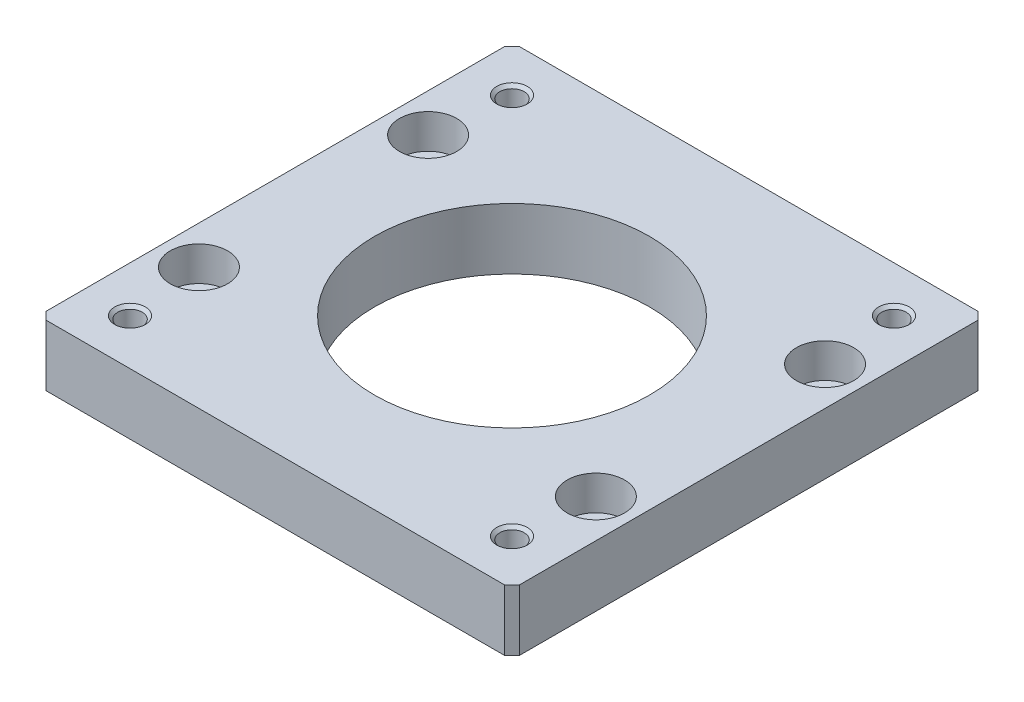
ISO-10303-21;
HEADER;
FILE_DESCRIPTION(('STEP AP214'),'2;1');
FILE_NAME('part.step','',(''),(''),'','','');
FILE_SCHEMA(('AUTOMOTIVE_DESIGN { 1 0 10303 214 1 1 1 1 }'));
ENDSEC;
DATA;
#1=APPLICATION_CONTEXT('core data for automotive mechanical design processes');
#2=APPLICATION_PROTOCOL_DEFINITION('international standard','automotive_design',2000,#1);
#3=PRODUCT_CONTEXT('',#1,'mechanical');
#4=PRODUCT('Part','Part','',(#3));
#5=PRODUCT_RELATED_PRODUCT_CATEGORY('part','',(#4));
#6=PRODUCT_DEFINITION_FORMATION('','',#4);
#7=PRODUCT_DEFINITION_CONTEXT('part definition',#1,'design');
#8=PRODUCT_DEFINITION('design','',#6,#7);
#9=PRODUCT_DEFINITION_SHAPE('','',#8);
#10=(LENGTH_UNIT() NAMED_UNIT(*) SI_UNIT(.MILLI.,.METRE.));
#11=(NAMED_UNIT(*) PLANE_ANGLE_UNIT() SI_UNIT($,.RADIAN.));
#12=(NAMED_UNIT(*) SI_UNIT($,.STERADIAN.) SOLID_ANGLE_UNIT());
#13=UNCERTAINTY_MEASURE_WITH_UNIT(LENGTH_MEASURE(1.E-05),#10,'distance_accuracy_value','');
#14=(GEOMETRIC_REPRESENTATION_CONTEXT(3) GLOBAL_UNCERTAINTY_ASSIGNED_CONTEXT((#13)) GLOBAL_UNIT_ASSIGNED_CONTEXT((#10,
#11,#12)) REPRESENTATION_CONTEXT('',''));
#15=CARTESIAN_POINT('',(0.,0.,0.));
#16=DIRECTION('',(0.,0.,1.));
#17=DIRECTION('',(1.,0.,0.));
#18=AXIS2_PLACEMENT_3D('',#15,#16,#17);
#19=CARTESIAN_POINT('',(-25.,7.59999999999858,-25.));
#20=DIRECTION('',(0.,1.,0.));
#21=DIRECTION('',(0.,0.,1.));
#22=AXIS2_PLACEMENT_3D('',#19,#20,#21);
#23=CONICAL_SURFACE('',#22,1.60000000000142,0.785398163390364);
#24=CARTESIAN_POINT('',(-25.,7.6,-25.));
#25=DIRECTION('',(0.,1.,0.));
#26=DIRECTION('',(1.,0.,0.));
#27=AXIS2_PLACEMENT_3D('',#24,#25,#26);
#28=CIRCLE('',#27,1.6);
#29=CARTESIAN_POINT('',(-23.4,7.6,-25.));
#30=VERTEX_POINT('',#29);
#31=EDGE_CURVE('E191',#30,#30,#28,.F.);
#32=ORIENTED_EDGE('',*,*,#31,.T.);
#33=EDGE_LOOP('',(#32));
#34=FACE_BOUND('',#33,.T.);
#35=CARTESIAN_POINT('',(-25.,8.00000000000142,-25.));
#36=DIRECTION('',(0.,1.,0.));
#37=DIRECTION('',(0.,0.,1.));
#38=AXIS2_PLACEMENT_3D('',#35,#36,#37);
#39=CIRCLE('',#38,1.99999999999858);
#40=CARTESIAN_POINT('',(-25.,8.00000000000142,-23.0000000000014));
#41=VERTEX_POINT('',#40);
#42=EDGE_CURVE('E174',#41,#41,#39,.T.);
#43=ORIENTED_EDGE('',*,*,#42,.T.);
#44=EDGE_LOOP('',(#43));
#45=FACE_BOUND('',#44,.T.);
#46=ADVANCED_FACE('F16',(#34,#45),#23,.F.);
#47=CARTESIAN_POINT('',(25.,7.59999999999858,-25.));
#48=DIRECTION('',(0.,1.,0.));
#49=DIRECTION('',(0.,0.,1.));
#50=AXIS2_PLACEMENT_3D('',#47,#48,#49);
#51=CONICAL_SURFACE('',#50,1.60000000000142,0.785398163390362);
#52=CARTESIAN_POINT('',(25.,7.6,-25.));
#53=DIRECTION('',(0.,1.,0.));
#54=DIRECTION('',(1.,0.,0.));
#55=AXIS2_PLACEMENT_3D('',#52,#53,#54);
#56=CIRCLE('',#55,1.6);
#57=CARTESIAN_POINT('',(26.6,7.6,-25.));
#58=VERTEX_POINT('',#57);
#59=EDGE_CURVE('E195',#58,#58,#56,.F.);
#60=ORIENTED_EDGE('',*,*,#59,.T.);
#61=EDGE_LOOP('',(#60));
#62=FACE_BOUND('',#61,.T.);
#63=CARTESIAN_POINT('',(25.,8.00000000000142,-25.));
#64=DIRECTION('',(0.,1.,0.));
#65=DIRECTION('',(0.,0.,1.));
#66=AXIS2_PLACEMENT_3D('',#63,#64,#65);
#67=CIRCLE('',#66,1.99999999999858);
#68=CARTESIAN_POINT('',(25.,8.00000000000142,-23.0000000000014));
#69=VERTEX_POINT('',#68);
#70=EDGE_CURVE('E171',#69,#69,#67,.T.);
#71=ORIENTED_EDGE('',*,*,#70,.T.);
#72=EDGE_LOOP('',(#71));
#73=FACE_BOUND('',#72,.T.);
#74=ADVANCED_FACE('F359',(#62,#73),#51,.F.);
#75=CARTESIAN_POINT('',(-25.,7.59999999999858,25.));
#76=DIRECTION('',(0.,1.,0.));
#77=DIRECTION('',(0.,0.,1.));
#78=AXIS2_PLACEMENT_3D('',#75,#76,#77);
#79=CONICAL_SURFACE('',#78,1.60000000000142,0.785398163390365);
#80=CARTESIAN_POINT('',(-25.,7.6,25.));
#81=DIRECTION('',(0.,1.,0.));
#82=DIRECTION('',(1.,0.,0.));
#83=AXIS2_PLACEMENT_3D('',#80,#81,#82);
#84=CIRCLE('',#83,1.6);
#85=CARTESIAN_POINT('',(-23.4,7.6,25.));
#86=VERTEX_POINT('',#85);
#87=EDGE_CURVE('E208',#86,#86,#84,.F.);
#88=ORIENTED_EDGE('',*,*,#87,.T.);
#89=EDGE_LOOP('',(#88));
#90=FACE_BOUND('',#89,.T.);
#91=CARTESIAN_POINT('',(-25.,8.00000000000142,25.));
#92=DIRECTION('',(0.,1.,0.));
#93=DIRECTION('',(0.,0.,1.));
#94=AXIS2_PLACEMENT_3D('',#91,#92,#93);
#95=CIRCLE('',#94,1.99999999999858);
#96=CARTESIAN_POINT('',(-25.,8.00000000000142,26.9999999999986));
#97=VERTEX_POINT('',#96);
#98=EDGE_CURVE('E168',#97,#97,#95,.T.);
#99=ORIENTED_EDGE('',*,*,#98,.T.);
#100=EDGE_LOOP('',(#99));
#101=FACE_BOUND('',#100,.T.);
#102=ADVANCED_FACE('F355',(#90,#101),#79,.F.);
#103=CARTESIAN_POINT('',(25.,7.59999999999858,25.));
#104=DIRECTION('',(0.,1.,0.));
#105=DIRECTION('',(0.,0.,1.));
#106=AXIS2_PLACEMENT_3D('',#103,#104,#105);
#107=CONICAL_SURFACE('',#106,1.60000000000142,0.785398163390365);
#108=CARTESIAN_POINT('',(25.,7.6,25.));
#109=DIRECTION('',(0.,1.,0.));
#110=DIRECTION('',(1.,0.,0.));
#111=AXIS2_PLACEMENT_3D('',#108,#109,#110);
#112=CIRCLE('',#111,1.6);
#113=CARTESIAN_POINT('',(26.6,7.6,25.));
#114=VERTEX_POINT('',#113);
#115=EDGE_CURVE('E200',#114,#114,#112,.F.);
#116=ORIENTED_EDGE('',*,*,#115,.T.);
#117=EDGE_LOOP('',(#116));
#118=FACE_BOUND('',#117,.T.);
#119=CARTESIAN_POINT('',(25.,8.00000000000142,25.));
#120=DIRECTION('',(0.,1.,0.));
#121=DIRECTION('',(0.,0.,1.));
#122=AXIS2_PLACEMENT_3D('',#119,#120,#121);
#123=CIRCLE('',#122,1.99999999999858);
#124=CARTESIAN_POINT('',(25.,8.00000000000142,26.9999999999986));
#125=VERTEX_POINT('',#124);
#126=EDGE_CURVE('E165',#125,#125,#123,.T.);
#127=ORIENTED_EDGE('',*,*,#126,.T.);
#128=EDGE_LOOP('',(#127));
#129=FACE_BOUND('',#128,.T.);
#130=ADVANCED_FACE('F352',(#118,#129),#107,.F.);
#131=CARTESIAN_POINT('',(25.98076211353,3.5,-15.));
#132=DIRECTION('',(0.,1.,0.));
#133=DIRECTION('',(0.,0.,1.));
#134=AXIS2_PLACEMENT_3D('',#131,#132,#133);
#135=CYLINDRICAL_SURFACE('',#134,3.75);
#136=CARTESIAN_POINT('',(25.98076211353,3.5,-15.));
#137=DIRECTION('',(0.,1.,0.));
#138=DIRECTION('',(0.,0.,1.));
#139=AXIS2_PLACEMENT_3D('',#136,#137,#138);
#140=CIRCLE('',#139,3.75);
#141=CARTESIAN_POINT('',(25.98076211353,3.5,-11.25));
#142=VERTEX_POINT('',#141);
#143=EDGE_CURVE('E20',#142,#142,#140,.F.);
#144=ORIENTED_EDGE('',*,*,#143,.T.);
#145=EDGE_LOOP('',(#144));
#146=FACE_BOUND('',#145,.T.);
#147=CARTESIAN_POINT('',(25.98076211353,8.,-15.));
#148=DIRECTION('',(0.,1.,0.));
#149=DIRECTION('',(0.,0.,1.));
#150=AXIS2_PLACEMENT_3D('',#147,#148,#149);
#151=CIRCLE('',#150,3.75);
#152=CARTESIAN_POINT('',(25.98076211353,8.,-11.25));
#153=VERTEX_POINT('',#152);
#154=EDGE_CURVE('E162',#153,#153,#151,.T.);
#155=ORIENTED_EDGE('',*,*,#154,.T.);
#156=EDGE_LOOP('',(#155));
#157=FACE_BOUND('',#156,.T.);
#158=ADVANCED_FACE('F348',(#146,#157),#135,.F.);
#159=CARTESIAN_POINT('',(-25.98076211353,3.5,-15.));
#160=DIRECTION('',(0.,1.,0.));
#161=DIRECTION('',(0.,0.,1.));
#162=AXIS2_PLACEMENT_3D('',#159,#160,#161);
#163=CYLINDRICAL_SURFACE('',#162,3.75);
#164=CARTESIAN_POINT('',(-25.98076211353,3.5,-15.));
#165=DIRECTION('',(0.,1.,0.));
#166=DIRECTION('',(0.,0.,1.));
#167=AXIS2_PLACEMENT_3D('',#164,#165,#166);
#168=CIRCLE('',#167,3.75);
#169=CARTESIAN_POINT('',(-25.98076211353,3.5,-11.25));
#170=VERTEX_POINT('',#169);
#171=EDGE_CURVE('E184',#170,#170,#168,.F.);
#172=ORIENTED_EDGE('',*,*,#171,.T.);
#173=EDGE_LOOP('',(#172));
#174=FACE_BOUND('',#173,.T.);
#175=CARTESIAN_POINT('',(-25.98076211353,8.,-15.));
#176=DIRECTION('',(0.,1.,0.));
#177=DIRECTION('',(0.,0.,1.));
#178=AXIS2_PLACEMENT_3D('',#175,#176,#177);
#179=CIRCLE('',#178,3.75);
#180=CARTESIAN_POINT('',(-25.98076211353,8.,-11.25));
#181=VERTEX_POINT('',#180);
#182=EDGE_CURVE('E159',#181,#181,#179,.T.);
#183=ORIENTED_EDGE('',*,*,#182,.T.);
#184=EDGE_LOOP('',(#183));
#185=FACE_BOUND('',#184,.T.);
#186=ADVANCED_FACE('F344',(#174,#185),#163,.F.);
#187=CARTESIAN_POINT('',(-25.98076211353,3.5,15.));
#188=DIRECTION('',(0.,1.,0.));
#189=DIRECTION('',(0.,0.,1.));
#190=AXIS2_PLACEMENT_3D('',#187,#188,#189);
#191=CYLINDRICAL_SURFACE('',#190,3.75);
#192=CARTESIAN_POINT('',(-25.98076211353,3.5,15.));
#193=DIRECTION('',(0.,1.,0.));
#194=DIRECTION('',(0.,0.,1.));
#195=AXIS2_PLACEMENT_3D('',#192,#193,#194);
#196=CIRCLE('',#195,3.75);
#197=CARTESIAN_POINT('',(-25.98076211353,3.5,18.75));
#198=VERTEX_POINT('',#197);
#199=EDGE_CURVE('E90',#198,#198,#196,.F.);
#200=ORIENTED_EDGE('',*,*,#199,.T.);
#201=EDGE_LOOP('',(#200));
#202=FACE_BOUND('',#201,.T.);
#203=CARTESIAN_POINT('',(-25.98076211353,8.,15.));
#204=DIRECTION('',(0.,1.,0.));
#205=DIRECTION('',(0.,0.,1.));
#206=AXIS2_PLACEMENT_3D('',#203,#204,#205);
#207=CIRCLE('',#206,3.75);
#208=CARTESIAN_POINT('',(-25.98076211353,8.,18.75));
#209=VERTEX_POINT('',#208);
#210=EDGE_CURVE('E107',#209,#209,#207,.T.);
#211=ORIENTED_EDGE('',*,*,#210,.T.);
#212=EDGE_LOOP('',(#211));
#213=FACE_BOUND('',#212,.T.);
#214=ADVANCED_FACE('F341',(#202,#213),#191,.F.);
#215=CARTESIAN_POINT('',(25.98076211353,3.5,15.));
#216=DIRECTION('',(0.,1.,0.));
#217=DIRECTION('',(0.,0.,1.));
#218=AXIS2_PLACEMENT_3D('',#215,#216,#217);
#219=CYLINDRICAL_SURFACE('',#218,3.75);
#220=CARTESIAN_POINT('',(25.98076211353,3.5,15.));
#221=DIRECTION('',(0.,1.,0.));
#222=DIRECTION('',(0.,0.,1.));
#223=AXIS2_PLACEMENT_3D('',#220,#221,#222);
#224=CIRCLE('',#223,3.75);
#225=CARTESIAN_POINT('',(25.98076211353,3.5,18.75));
#226=VERTEX_POINT('',#225);
#227=EDGE_CURVE('E186',#226,#226,#224,.F.);
#228=ORIENTED_EDGE('',*,*,#227,.T.);
#229=EDGE_LOOP('',(#228));
#230=FACE_BOUND('',#229,.T.);
#231=CARTESIAN_POINT('',(25.98076211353,8.,15.));
#232=DIRECTION('',(0.,1.,0.));
#233=DIRECTION('',(0.,0.,1.));
#234=AXIS2_PLACEMENT_3D('',#231,#232,#233);
#235=CIRCLE('',#234,3.75);
#236=CARTESIAN_POINT('',(25.98076211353,8.,18.75));
#237=VERTEX_POINT('',#236);
#238=EDGE_CURVE('E104',#237,#237,#235,.T.);
#239=ORIENTED_EDGE('',*,*,#238,.T.);
#240=EDGE_LOOP('',(#239));
#241=FACE_BOUND('',#240,.T.);
#242=ADVANCED_FACE('F338',(#230,#241),#219,.F.);
#243=CARTESIAN_POINT('',(-31.08184,8.16,-29.91816));
#244=DIRECTION('',(-0.707106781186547,0.,-0.707106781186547));
#245=DIRECTION('',(0.707106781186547,0.,-0.707106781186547));
#246=AXIS2_PLACEMENT_3D('',#243,#244,#245);
#247=PLANE('',#246);
#248=DIRECTION('',(0.707106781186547,0.,-0.707106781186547));
#249=VECTOR('',#248,1.);
#250=CARTESIAN_POINT('',(-31.08184,8.,-29.91816));
#251=LINE('',#250,#249);
#252=CARTESIAN_POINT('',(-31.,8.,-30.));
#253=VERTEX_POINT('',#252);
#254=CARTESIAN_POINT('',(-30.,8.,-31.));
#255=VERTEX_POINT('',#254);
#256=EDGE_CURVE('E177',#253,#255,#251,.T.);
#257=ORIENTED_EDGE('',*,*,#256,.T.);
#258=DIRECTION('',(0.,1.,0.));
#259=VECTOR('',#258,1.);
#260=CARTESIAN_POINT('',(-30.,4.,-31.));
#261=LINE('',#260,#259);
#262=CARTESIAN_POINT('',(-30.,0.,-31.));
#263=VERTEX_POINT('',#262);
#264=EDGE_CURVE('E100',#255,#263,#261,.F.);
#265=ORIENTED_EDGE('',*,*,#264,.T.);
#266=DIRECTION('',(-0.707106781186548,0.,0.707106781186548));
#267=VECTOR('',#266,1.);
#268=CARTESIAN_POINT('',(-30.5,0.,-30.5));
#269=LINE('',#268,#267);
#270=CARTESIAN_POINT('',(-31.,0.,-30.));
#271=VERTEX_POINT('',#270);
#272=EDGE_CURVE('E203',#271,#263,#269,.F.);
#273=ORIENTED_EDGE('',*,*,#272,.F.);
#274=DIRECTION('',(0.,-1.,0.));
#275=VECTOR('',#274,1.);
#276=CARTESIAN_POINT('',(-31.,4.,-30.));
#277=LINE('',#276,#275);
#278=EDGE_CURVE('E215',#271,#253,#277,.F.);
#279=ORIENTED_EDGE('',*,*,#278,.T.);
#280=EDGE_LOOP('',(#257,#265,#273,#279));
#281=FACE_BOUND('',#280,.T.);
#282=ADVANCED_FACE('F261',(#281),#247,.T.);
#283=CARTESIAN_POINT('',(-29.91816,8.16,31.08184));
#284=DIRECTION('',(-0.707106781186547,0.,0.707106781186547));
#285=DIRECTION('',(-0.707106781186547,0.,-0.707106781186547));
#286=AXIS2_PLACEMENT_3D('',#283,#284,#285);
#287=PLANE('',#286);
#288=DIRECTION('',(-0.707106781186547,0.,-0.707106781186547));
#289=VECTOR('',#288,1.);
#290=CARTESIAN_POINT('',(-29.91816,8.,31.08184));
#291=LINE('',#290,#289);
#292=CARTESIAN_POINT('',(-30.,8.,31.));
#293=VERTEX_POINT('',#292);
#294=CARTESIAN_POINT('',(-31.,8.,30.));
#295=VERTEX_POINT('',#294);
#296=EDGE_CURVE('E179',#293,#295,#291,.T.);
#297=ORIENTED_EDGE('',*,*,#296,.T.);
#298=DIRECTION('',(0.,1.,0.));
#299=VECTOR('',#298,1.);
#300=CARTESIAN_POINT('',(-31.,4.,30.));
#301=LINE('',#300,#299);
#302=CARTESIAN_POINT('',(-31.,0.,30.));
#303=VERTEX_POINT('',#302);
#304=EDGE_CURVE('E214',#295,#303,#301,.F.);
#305=ORIENTED_EDGE('',*,*,#304,.T.);
#306=DIRECTION('',(0.707106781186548,0.,0.707106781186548));
#307=VECTOR('',#306,1.);
#308=CARTESIAN_POINT('',(-30.5,0.,30.5));
#309=LINE('',#308,#307);
#310=CARTESIAN_POINT('',(-30.,0.,31.));
#311=VERTEX_POINT('',#310);
#312=EDGE_CURVE('E257',#311,#303,#309,.F.);
#313=ORIENTED_EDGE('',*,*,#312,.F.);
#314=DIRECTION('',(0.,-1.,0.));
#315=VECTOR('',#314,1.);
#316=CARTESIAN_POINT('',(-30.,4.,31.));
#317=LINE('',#316,#315);
#318=EDGE_CURVE('E222',#311,#293,#317,.F.);
#319=ORIENTED_EDGE('',*,*,#318,.T.);
#320=EDGE_LOOP('',(#297,#305,#313,#319));
#321=FACE_BOUND('',#320,.T.);
#322=ADVANCED_FACE('F267',(#321),#287,.T.);
#323=CARTESIAN_POINT('',(29.91816,8.16,-31.08184));
#324=DIRECTION('',(0.707106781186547,0.,-0.707106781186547));
#325=DIRECTION('',(0.707106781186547,0.,0.707106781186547));
#326=AXIS2_PLACEMENT_3D('',#323,#324,#325);
#327=PLANE('',#326);
#328=DIRECTION('',(0.707106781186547,0.,0.707106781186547));
#329=VECTOR('',#328,1.);
#330=CARTESIAN_POINT('',(29.91816,8.,-31.08184));
#331=LINE('',#330,#329);
#332=CARTESIAN_POINT('',(30.,8.,-31.));
#333=VERTEX_POINT('',#332);
#334=CARTESIAN_POINT('',(31.,8.,-30.));
#335=VERTEX_POINT('',#334);
#336=EDGE_CURVE('E80',#333,#335,#331,.T.);
#337=ORIENTED_EDGE('',*,*,#336,.T.);
#338=DIRECTION('',(0.,1.,0.));
#339=VECTOR('',#338,1.);
#340=CARTESIAN_POINT('',(31.,4.,-30.));
#341=LINE('',#340,#339);
#342=CARTESIAN_POINT('',(31.,0.,-30.));
#343=VERTEX_POINT('',#342);
#344=EDGE_CURVE('E113',#335,#343,#341,.F.);
#345=ORIENTED_EDGE('',*,*,#344,.T.);
#346=DIRECTION('',(-0.707106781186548,0.,-0.707106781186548));
#347=VECTOR('',#346,1.);
#348=CARTESIAN_POINT('',(30.5,0.,-30.5));
#349=LINE('',#348,#347);
#350=CARTESIAN_POINT('',(30.,0.,-31.));
#351=VERTEX_POINT('',#350);
#352=EDGE_CURVE('E103',#351,#343,#349,.F.);
#353=ORIENTED_EDGE('',*,*,#352,.F.);
#354=DIRECTION('',(0.,-1.,0.));
#355=VECTOR('',#354,1.);
#356=CARTESIAN_POINT('',(30.,4.,-31.));
#357=LINE('',#356,#355);
#358=EDGE_CURVE('E97',#351,#333,#357,.F.);
#359=ORIENTED_EDGE('',*,*,#358,.T.);
#360=EDGE_LOOP('',(#337,#345,#353,#359));
#361=FACE_BOUND('',#360,.T.);
#362=ADVANCED_FACE('F102',(#361),#327,.T.);
#363=CARTESIAN_POINT('',(31.08184,8.16,29.91816));
#364=DIRECTION('',(0.707106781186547,0.,0.707106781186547));
#365=DIRECTION('',(-0.707106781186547,0.,0.707106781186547));
#366=AXIS2_PLACEMENT_3D('',#363,#364,#365);
#367=PLANE('',#366);
#368=DIRECTION('',(-0.707106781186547,0.,0.707106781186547));
#369=VECTOR('',#368,1.);
#370=CARTESIAN_POINT('',(31.08184,8.,29.91816));
#371=LINE('',#370,#369);
#372=CARTESIAN_POINT('',(31.,8.,30.));
#373=VERTEX_POINT('',#372);
#374=CARTESIAN_POINT('',(30.,8.,31.));
#375=VERTEX_POINT('',#374);
#376=EDGE_CURVE('E89',#373,#375,#371,.T.);
#377=ORIENTED_EDGE('',*,*,#376,.T.);
#378=DIRECTION('',(0.,1.,0.));
#379=VECTOR('',#378,1.);
#380=CARTESIAN_POINT('',(30.,4.,31.));
#381=LINE('',#380,#379);
#382=CARTESIAN_POINT('',(30.,0.,31.));
#383=VERTEX_POINT('',#382);
#384=EDGE_CURVE('E111',#375,#383,#381,.F.);
#385=ORIENTED_EDGE('',*,*,#384,.T.);
#386=DIRECTION('',(0.707106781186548,0.,-0.707106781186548));
#387=VECTOR('',#386,1.);
#388=CARTESIAN_POINT('',(30.5,0.,30.5));
#389=LINE('',#388,#387);
#390=CARTESIAN_POINT('',(31.,0.,30.));
#391=VERTEX_POINT('',#390);
#392=EDGE_CURVE('E35',#391,#383,#389,.F.);
#393=ORIENTED_EDGE('',*,*,#392,.F.);
#394=DIRECTION('',(0.,-1.,0.));
#395=VECTOR('',#394,1.);
#396=CARTESIAN_POINT('',(31.,4.,30.));
#397=LINE('',#396,#395);
#398=EDGE_CURVE('E114',#391,#373,#397,.F.);
#399=ORIENTED_EDGE('',*,*,#398,.T.);
#400=EDGE_LOOP('',(#377,#385,#393,#399));
#401=FACE_BOUND('',#400,.T.);
#402=ADVANCED_FACE('F228',(#401),#367,.T.);
#403=CARTESIAN_POINT('',(-25.,0.4,25.));
#404=DIRECTION('',(0.,1.,0.));
#405=DIRECTION('',(0.,0.,1.));
#406=AXIS2_PLACEMENT_3D('',#403,#404,#405);
#407=CYLINDRICAL_SURFACE('',#406,1.6);
#408=CARTESIAN_POINT('',(-25.,0.400000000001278,25.));
#409=DIRECTION('',(0.,-1.,0.));
#410=DIRECTION('',(0.,0.,-1.));
#411=AXIS2_PLACEMENT_3D('',#408,#409,#410);
#412=CIRCLE('',#411,1.60000000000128);
#413=CARTESIAN_POINT('',(-25.,0.400000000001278,23.3999999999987));
#414=VERTEX_POINT('',#413);
#415=EDGE_CURVE('E227',#414,#414,#412,.T.);
#416=ORIENTED_EDGE('',*,*,#415,.T.);
#417=EDGE_LOOP('',(#416));
#418=FACE_BOUND('',#417,.T.);
#419=ORIENTED_EDGE('',*,*,#87,.F.);
#420=EDGE_LOOP('',(#419));
#421=FACE_BOUND('',#420,.T.);
#422=ADVANCED_FACE('F333',(#418,#421),#407,.F.);
#423=CARTESIAN_POINT('',(25.,0.4,25.));
#424=DIRECTION('',(0.,1.,0.));
#425=DIRECTION('',(0.,0.,1.));
#426=AXIS2_PLACEMENT_3D('',#423,#424,#425);
#427=CYLINDRICAL_SURFACE('',#426,1.6);
#428=CARTESIAN_POINT('',(25.,0.400000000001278,25.));
#429=DIRECTION('',(0.,-1.,0.));
#430=DIRECTION('',(0.,0.,-1.));
#431=AXIS2_PLACEMENT_3D('',#428,#429,#430);
#432=CIRCLE('',#431,1.60000000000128);
#433=CARTESIAN_POINT('',(25.,0.400000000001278,23.3999999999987));
#434=VERTEX_POINT('',#433);
#435=EDGE_CURVE('E251',#434,#434,#432,.T.);
#436=ORIENTED_EDGE('',*,*,#435,.T.);
#437=EDGE_LOOP('',(#436));
#438=FACE_BOUND('',#437,.T.);
#439=ORIENTED_EDGE('',*,*,#115,.F.);
#440=EDGE_LOOP('',(#439));
#441=FACE_BOUND('',#440,.T.);
#442=ADVANCED_FACE('F329',(#438,#441),#427,.F.);
#443=CARTESIAN_POINT('',(25.,0.4,-25.));
#444=DIRECTION('',(0.,1.,0.));
#445=DIRECTION('',(0.,0.,1.));
#446=AXIS2_PLACEMENT_3D('',#443,#444,#445);
#447=CYLINDRICAL_SURFACE('',#446,1.6);
#448=CARTESIAN_POINT('',(25.,0.400000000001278,-25.));
#449=DIRECTION('',(0.,-1.,0.));
#450=DIRECTION('',(0.,0.,-1.));
#451=AXIS2_PLACEMENT_3D('',#448,#449,#450);
#452=CIRCLE('',#451,1.60000000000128);
#453=CARTESIAN_POINT('',(25.,0.400000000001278,-26.6000000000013));
#454=VERTEX_POINT('',#453);
#455=EDGE_CURVE('E248',#454,#454,#452,.T.);
#456=ORIENTED_EDGE('',*,*,#455,.T.);
#457=EDGE_LOOP('',(#456));
#458=FACE_BOUND('',#457,.T.);
#459=ORIENTED_EDGE('',*,*,#59,.F.);
#460=EDGE_LOOP('',(#459));
#461=FACE_BOUND('',#460,.T.);
#462=ADVANCED_FACE('F325',(#458,#461),#447,.F.);
#463=CARTESIAN_POINT('',(-25.,0.4,-25.));
#464=DIRECTION('',(0.,1.,0.));
#465=DIRECTION('',(0.,0.,1.));
#466=AXIS2_PLACEMENT_3D('',#463,#464,#465);
#467=CYLINDRICAL_SURFACE('',#466,1.6);
#468=CARTESIAN_POINT('',(-25.,0.400000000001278,-25.));
#469=DIRECTION('',(0.,-1.,0.));
#470=DIRECTION('',(0.,0.,-1.));
#471=AXIS2_PLACEMENT_3D('',#468,#469,#470);
#472=CIRCLE('',#471,1.60000000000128);
#473=CARTESIAN_POINT('',(-25.,0.400000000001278,-26.6000000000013));
#474=VERTEX_POINT('',#473);
#475=EDGE_CURVE('E155',#474,#474,#472,.T.);
#476=ORIENTED_EDGE('',*,*,#475,.T.);
#477=EDGE_LOOP('',(#476));
#478=FACE_BOUND('',#477,.T.);
#479=ORIENTED_EDGE('',*,*,#31,.F.);
#480=EDGE_LOOP('',(#479));
#481=FACE_BOUND('',#480,.T.);
#482=ADVANCED_FACE('F321',(#478,#481),#467,.F.);
#483=CARTESIAN_POINT('',(-30.91999259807,3.5,19.50812731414));
#484=DIRECTION('',(0.,1.,0.));
#485=DIRECTION('',(1.,0.,0.));
#486=AXIS2_PLACEMENT_3D('',#483,#484,#485);
#487=PLANE('',#486);
#488=CARTESIAN_POINT('',(25.98076211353,3.5,-15.));
#489=DIRECTION('',(0.,1.,0.));
#490=DIRECTION('',(0.,0.,1.));
#491=AXIS2_PLACEMENT_3D('',#488,#489,#490);
#492=CIRCLE('',#491,2.25);
#493=CARTESIAN_POINT('',(25.98076211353,3.5,-12.75));
#494=VERTEX_POINT('',#493);
#495=EDGE_CURVE('E153',#494,#494,#492,.F.);
#496=ORIENTED_EDGE('',*,*,#495,.T.);
#497=EDGE_LOOP('',(#496));
#498=FACE_BOUND('',#497,.T.);
#499=ORIENTED_EDGE('',*,*,#143,.F.);
#500=EDGE_LOOP('',(#499));
#501=FACE_BOUND('',#500,.T.);
#502=ADVANCED_FACE('F324',(#498,#501),#487,.T.);
#503=CARTESIAN_POINT('',(-30.91999259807,3.5,19.50812731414));
#504=DIRECTION('',(0.,1.,0.));
#505=DIRECTION('',(1.,0.,0.));
#506=AXIS2_PLACEMENT_3D('',#503,#504,#505);
#507=PLANE('',#506);
#508=CARTESIAN_POINT('',(25.98076211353,3.5,15.));
#509=DIRECTION('',(0.,1.,0.));
#510=DIRECTION('',(0.,0.,1.));
#511=AXIS2_PLACEMENT_3D('',#508,#509,#510);
#512=CIRCLE('',#511,2.25);
#513=CARTESIAN_POINT('',(25.98076211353,3.5,17.25));
#514=VERTEX_POINT('',#513);
#515=EDGE_CURVE('E150',#514,#514,#512,.F.);
#516=ORIENTED_EDGE('',*,*,#515,.T.);
#517=EDGE_LOOP('',(#516));
#518=FACE_BOUND('',#517,.T.);
#519=ORIENTED_EDGE('',*,*,#227,.F.);
#520=EDGE_LOOP('',(#519));
#521=FACE_BOUND('',#520,.T.);
#522=ADVANCED_FACE('F376',(#518,#521),#507,.T.);
#523=CARTESIAN_POINT('',(-30.91999259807,3.5,19.50812731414));
#524=DIRECTION('',(0.,1.,0.));
#525=DIRECTION('',(1.,0.,0.));
#526=AXIS2_PLACEMENT_3D('',#523,#524,#525);
#527=PLANE('',#526);
#528=CARTESIAN_POINT('',(-25.98076211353,3.5,-15.));
#529=DIRECTION('',(0.,1.,0.));
#530=DIRECTION('',(0.,0.,1.));
#531=AXIS2_PLACEMENT_3D('',#528,#529,#530);
#532=CIRCLE('',#531,2.25);
#533=CARTESIAN_POINT('',(-25.98076211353,3.5,-12.75));
#534=VERTEX_POINT('',#533);
#535=EDGE_CURVE('E147',#534,#534,#532,.F.);
#536=ORIENTED_EDGE('',*,*,#535,.T.);
#537=EDGE_LOOP('',(#536));
#538=FACE_BOUND('',#537,.T.);
#539=ORIENTED_EDGE('',*,*,#171,.F.);
#540=EDGE_LOOP('',(#539));
#541=FACE_BOUND('',#540,.T.);
#542=ADVANCED_FACE('F380',(#538,#541),#527,.T.);
#543=CARTESIAN_POINT('',(-30.91999259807,3.5,19.50812731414));
#544=DIRECTION('',(0.,1.,0.));
#545=DIRECTION('',(1.,0.,0.));
#546=AXIS2_PLACEMENT_3D('',#543,#544,#545);
#547=PLANE('',#546);
#548=CARTESIAN_POINT('',(-25.98076211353,3.5,15.));
#549=DIRECTION('',(0.,1.,0.));
#550=DIRECTION('',(0.,0.,1.));
#551=AXIS2_PLACEMENT_3D('',#548,#549,#550);
#552=CIRCLE('',#551,2.25);
#553=CARTESIAN_POINT('',(-25.98076211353,3.5,17.25));
#554=VERTEX_POINT('',#553);
#555=EDGE_CURVE('E144',#554,#554,#552,.F.);
#556=ORIENTED_EDGE('',*,*,#555,.T.);
#557=EDGE_LOOP('',(#556));
#558=FACE_BOUND('',#557,.T.);
#559=ORIENTED_EDGE('',*,*,#199,.F.);
#560=EDGE_LOOP('',(#559));
#561=FACE_BOUND('',#560,.T.);
#562=ADVANCED_FACE('F384',(#558,#561),#547,.T.);
#563=CARTESIAN_POINT('',(-32.24,8.,32.24));
#564=DIRECTION('',(0.,1.,0.));
#565=DIRECTION('',(1.,0.,0.));
#566=AXIS2_PLACEMENT_3D('',#563,#564,#565);
#567=PLANE('',#566);
#568=CARTESIAN_POINT('',(0.,8.,0.));
#569=DIRECTION('',(0.,1.,0.));
#570=DIRECTION('',(0.,0.,1.));
#571=AXIS2_PLACEMENT_3D('',#568,#569,#570);
#572=CIRCLE('',#571,18.);
#573=CARTESIAN_POINT('',(0.,8.,18.));
#574=VERTEX_POINT('',#573);
#575=EDGE_CURVE('E140',#574,#574,#572,.F.);
#576=ORIENTED_EDGE('',*,*,#575,.T.);
#577=EDGE_LOOP('',(#576));
#578=FACE_BOUND('',#577,.T.);
#579=ORIENTED_EDGE('',*,*,#238,.F.);
#580=EDGE_LOOP('',(#579));
#581=FACE_BOUND('',#580,.T.);
#582=ORIENTED_EDGE('',*,*,#210,.F.);
#583=EDGE_LOOP('',(#582));
#584=FACE_BOUND('',#583,.T.);
#585=ORIENTED_EDGE('',*,*,#182,.F.);
#586=EDGE_LOOP('',(#585));
#587=FACE_BOUND('',#586,.T.);
#588=ORIENTED_EDGE('',*,*,#154,.F.);
#589=EDGE_LOOP('',(#588));
#590=FACE_BOUND('',#589,.T.);
#591=ORIENTED_EDGE('',*,*,#126,.F.);
#592=EDGE_LOOP('',(#591));
#593=FACE_BOUND('',#592,.T.);
#594=ORIENTED_EDGE('',*,*,#98,.F.);
#595=EDGE_LOOP('',(#594));
#596=FACE_BOUND('',#595,.T.);
#597=ORIENTED_EDGE('',*,*,#70,.F.);
#598=EDGE_LOOP('',(#597));
#599=FACE_BOUND('',#598,.T.);
#600=ORIENTED_EDGE('',*,*,#42,.F.);
#601=EDGE_LOOP('',(#600));
#602=FACE_BOUND('',#601,.T.);
#603=ORIENTED_EDGE('',*,*,#256,.F.);
#604=DIRECTION('',(0.,0.,-1.));
#605=VECTOR('',#604,1.);
#606=CARTESIAN_POINT('',(-31.,8.,0.));
#607=LINE('',#606,#605);
#608=EDGE_CURVE('E211',#253,#295,#607,.F.);
#609=ORIENTED_EDGE('',*,*,#608,.T.);
#610=ORIENTED_EDGE('',*,*,#296,.F.);
#611=DIRECTION('',(-1.,0.,0.));
#612=VECTOR('',#611,1.);
#613=CARTESIAN_POINT('',(0.,8.,31.));
#614=LINE('',#613,#612);
#615=EDGE_CURVE('E219',#293,#375,#614,.F.);
#616=ORIENTED_EDGE('',*,*,#615,.T.);
#617=ORIENTED_EDGE('',*,*,#376,.F.);
#618=DIRECTION('',(0.,0.,1.));
#619=VECTOR('',#618,1.);
#620=CARTESIAN_POINT('',(31.,8.,0.));
#621=LINE('',#620,#619);
#622=EDGE_CURVE('E85',#373,#335,#621,.F.);
#623=ORIENTED_EDGE('',*,*,#622,.T.);
#624=ORIENTED_EDGE('',*,*,#336,.F.);
#625=DIRECTION('',(1.,0.,0.));
#626=VECTOR('',#625,1.);
#627=CARTESIAN_POINT('',(0.,8.,-31.));
#628=LINE('',#627,#626);
#629=EDGE_CURVE('E83',#333,#255,#628,.F.);
#630=ORIENTED_EDGE('',*,*,#629,.T.);
#631=EDGE_LOOP('',(#603,#609,#610,#616,#617,#623,#624,#630));
#632=FACE_BOUND('',#631,.T.);
#633=ADVANCED_FACE('F82',(#578,#581,#584,#587,#590,#593,#596,#599,#602,#632),#567,.T.);
#634=CARTESIAN_POINT('',(31.2,-0.16,-31.));
#635=DIRECTION('',(0.,0.,-1.));
#636=DIRECTION('',(-1.,0.,0.));
#637=AXIS2_PLACEMENT_3D('',#634,#635,#636);
#638=PLANE('',#637);
#639=ORIENTED_EDGE('',*,*,#264,.F.);
#640=ORIENTED_EDGE('',*,*,#629,.F.);
#641=ORIENTED_EDGE('',*,*,#358,.F.);
#642=DIRECTION('',(-1.,0.,0.));
#643=VECTOR('',#642,1.);
#644=CARTESIAN_POINT('',(0.,0.,-31.));
#645=LINE('',#644,#643);
#646=EDGE_CURVE('E143',#351,#263,#645,.T.);
#647=ORIENTED_EDGE('',*,*,#646,.T.);
#648=EDGE_LOOP('',(#639,#640,#641,#647));
#649=FACE_BOUND('',#648,.T.);
#650=ADVANCED_FACE('F95',(#649),#638,.T.);
#651=CARTESIAN_POINT('',(-31.,-0.16,-31.2));
#652=DIRECTION('',(-1.,0.,0.));
#653=DIRECTION('',(0.,0.,1.));
#654=AXIS2_PLACEMENT_3D('',#651,#652,#653);
#655=PLANE('',#654);
#656=ORIENTED_EDGE('',*,*,#304,.F.);
#657=ORIENTED_EDGE('',*,*,#608,.F.);
#658=ORIENTED_EDGE('',*,*,#278,.F.);
#659=DIRECTION('',(0.,0.,1.));
#660=VECTOR('',#659,1.);
#661=CARTESIAN_POINT('',(-31.,0.,0.));
#662=LINE('',#661,#660);
#663=EDGE_CURVE('E240',#271,#303,#662,.T.);
#664=ORIENTED_EDGE('',*,*,#663,.T.);
#665=EDGE_LOOP('',(#656,#657,#658,#664));
#666=FACE_BOUND('',#665,.T.);
#667=ADVANCED_FACE('F265',(#666),#655,.T.);
#668=CARTESIAN_POINT('',(-31.2,-0.16,31.));
#669=DIRECTION('',(0.,0.,1.));
#670=DIRECTION('',(1.,0.,0.));
#671=AXIS2_PLACEMENT_3D('',#668,#669,#670);
#672=PLANE('',#671);
#673=ORIENTED_EDGE('',*,*,#384,.F.);
#674=ORIENTED_EDGE('',*,*,#615,.F.);
#675=ORIENTED_EDGE('',*,*,#318,.F.);
#676=DIRECTION('',(1.,0.,0.));
#677=VECTOR('',#676,1.);
#678=CARTESIAN_POINT('',(0.,0.,31.));
#679=LINE('',#678,#677);
#680=EDGE_CURVE('E237',#311,#383,#679,.T.);
#681=ORIENTED_EDGE('',*,*,#680,.T.);
#682=EDGE_LOOP('',(#673,#674,#675,#681));
#683=FACE_BOUND('',#682,.T.);
#684=ADVANCED_FACE('F271',(#683),#672,.T.);
#685=CARTESIAN_POINT('',(31.,-0.16,31.2));
#686=DIRECTION('',(1.,0.,0.));
#687=DIRECTION('',(0.,0.,-1.));
#688=AXIS2_PLACEMENT_3D('',#685,#686,#687);
#689=PLANE('',#688);
#690=ORIENTED_EDGE('',*,*,#398,.F.);
#691=DIRECTION('',(0.,0.,-1.));
#692=VECTOR('',#691,1.);
#693=CARTESIAN_POINT('',(31.,0.,0.));
#694=LINE('',#693,#692);
#695=EDGE_CURVE('E139',#391,#343,#694,.T.);
#696=ORIENTED_EDGE('',*,*,#695,.T.);
#697=ORIENTED_EDGE('',*,*,#344,.F.);
#698=ORIENTED_EDGE('',*,*,#622,.F.);
#699=EDGE_LOOP('',(#690,#696,#697,#698));
#700=FACE_BOUND('',#699,.T.);
#701=ADVANCED_FACE('F233',(#700),#689,.T.);
#702=CARTESIAN_POINT('',(-25.,0.400000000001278,25.));
#703=DIRECTION('',(0.,-1.,0.));
#704=DIRECTION('',(0.,0.,-1.));
#705=AXIS2_PLACEMENT_3D('',#702,#703,#704);
#706=CONICAL_SURFACE('',#705,1.60000000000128,0.785398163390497);
#707=ORIENTED_EDGE('',*,*,#415,.F.);
#708=EDGE_LOOP('',(#707));
#709=FACE_BOUND('',#708,.T.);
#710=CARTESIAN_POINT('',(-25.,-1.50183684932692E-12,25.));
#711=DIRECTION('',(0.,-1.,0.));
#712=DIRECTION('',(0.,0.,-1.));
#713=AXIS2_PLACEMENT_3D('',#710,#711,#712);
#714=CIRCLE('',#713,1.9999999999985);
#715=CARTESIAN_POINT('',(-25.,-1.50183684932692E-12,23.0000000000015));
#716=VERTEX_POINT('',#715);
#717=EDGE_CURVE('E136',#716,#716,#714,.T.);
#718=ORIENTED_EDGE('',*,*,#717,.T.);
#719=EDGE_LOOP('',(#718));
#720=FACE_BOUND('',#719,.T.);
#721=ADVANCED_FACE('F279',(#709,#720),#706,.F.);
#722=CARTESIAN_POINT('',(25.,0.400000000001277,25.));
#723=DIRECTION('',(0.,-1.,0.));
#724=DIRECTION('',(0.,0.,-1.));
#725=AXIS2_PLACEMENT_3D('',#722,#723,#724);
#726=CONICAL_SURFACE('',#725,1.60000000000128,0.785398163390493);
#727=ORIENTED_EDGE('',*,*,#435,.F.);
#728=EDGE_LOOP('',(#727));
#729=FACE_BOUND('',#728,.T.);
#730=CARTESIAN_POINT('',(25.,-1.50270421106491E-12,25.));
#731=DIRECTION('',(0.,-1.,0.));
#732=DIRECTION('',(0.,0.,-1.));
#733=AXIS2_PLACEMENT_3D('',#730,#731,#732);
#734=CIRCLE('',#733,1.9999999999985);
#735=CARTESIAN_POINT('',(25.,-1.50270421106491E-12,23.0000000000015));
#736=VERTEX_POINT('',#735);
#737=EDGE_CURVE('E133',#736,#736,#734,.T.);
#738=ORIENTED_EDGE('',*,*,#737,.T.);
#739=EDGE_LOOP('',(#738));
#740=FACE_BOUND('',#739,.T.);
#741=ADVANCED_FACE('F309',(#729,#740),#726,.F.);
#742=CARTESIAN_POINT('',(25.,0.400000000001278,-25.));
#743=DIRECTION('',(0.,-1.,0.));
#744=DIRECTION('',(0.,0.,-1.));
#745=AXIS2_PLACEMENT_3D('',#742,#743,#744);
#746=CONICAL_SURFACE('',#745,1.60000000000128,0.785398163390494);
#747=ORIENTED_EDGE('',*,*,#455,.F.);
#748=EDGE_LOOP('',(#747));
#749=FACE_BOUND('',#748,.T.);
#750=CARTESIAN_POINT('',(25.,-1.5017826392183E-12,-25.));
#751=DIRECTION('',(0.,-1.,0.));
#752=DIRECTION('',(1.,0.,0.));
#753=AXIS2_PLACEMENT_3D('',#750,#751,#752);
#754=CIRCLE('',#753,1.9999999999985);
#755=CARTESIAN_POINT('',(26.9999999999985,-1.50181652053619E-12,-25.));
#756=VERTEX_POINT('',#755);
#757=EDGE_CURVE('E130',#756,#756,#754,.T.);
#758=ORIENTED_EDGE('',*,*,#757,.T.);
#759=EDGE_LOOP('',(#758));
#760=FACE_BOUND('',#759,.T.);
#761=ADVANCED_FACE('F315',(#749,#760),#746,.F.);
#762=CARTESIAN_POINT('',(-25.,0.400000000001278,-25.));
#763=DIRECTION('',(0.,-1.,0.));
#764=DIRECTION('',(0.,0.,-1.));
#765=AXIS2_PLACEMENT_3D('',#762,#763,#764);
#766=CONICAL_SURFACE('',#765,1.60000000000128,0.785398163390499);
#767=ORIENTED_EDGE('',*,*,#475,.F.);
#768=EDGE_LOOP('',(#767));
#769=FACE_BOUND('',#768,.T.);
#770=CARTESIAN_POINT('',(-25.,-1.50308368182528E-12,-25.));
#771=DIRECTION('',(0.,-1.,0.));
#772=DIRECTION('',(1.,0.,0.));
#773=AXIS2_PLACEMENT_3D('',#770,#771,#772);
#774=CIRCLE('',#773,1.9999999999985);
#775=CARTESIAN_POINT('',(-23.0000000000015,-1.50311756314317E-12,-25.));
#776=VERTEX_POINT('',#775);
#777=EDGE_CURVE('E127',#776,#776,#774,.T.);
#778=ORIENTED_EDGE('',*,*,#777,.T.);
#779=EDGE_LOOP('',(#778));
#780=FACE_BOUND('',#779,.T.);
#781=ADVANCED_FACE('F435',(#769,#780),#766,.F.);
#782=CARTESIAN_POINT('',(25.98076211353,0.,-15.));
#783=DIRECTION('',(0.,1.,0.));
#784=DIRECTION('',(0.,0.,1.));
#785=AXIS2_PLACEMENT_3D('',#782,#783,#784);
#786=CYLINDRICAL_SURFACE('',#785,2.25);
#787=CARTESIAN_POINT('',(25.98076211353,0.,-15.));
#788=DIRECTION('',(0.,1.,0.));
#789=DIRECTION('',(0.,0.,1.));
#790=AXIS2_PLACEMENT_3D('',#787,#788,#789);
#791=CIRCLE('',#790,2.25);
#792=CARTESIAN_POINT('',(25.98076211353,0.,-12.75));
#793=VERTEX_POINT('',#792);
#794=EDGE_CURVE('E124',#793,#793,#791,.F.);
#795=ORIENTED_EDGE('',*,*,#794,.T.);
#796=EDGE_LOOP('',(#795));
#797=FACE_BOUND('',#796,.T.);
#798=ORIENTED_EDGE('',*,*,#495,.F.);
#799=EDGE_LOOP('',(#798));
#800=FACE_BOUND('',#799,.T.);
#801=ADVANCED_FACE('F444',(#797,#800),#786,.F.);
#802=CARTESIAN_POINT('',(25.98076211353,0.,15.));
#803=DIRECTION('',(0.,1.,0.));
#804=DIRECTION('',(0.,0.,1.));
#805=AXIS2_PLACEMENT_3D('',#802,#803,#804);
#806=CYLINDRICAL_SURFACE('',#805,2.25);
#807=CARTESIAN_POINT('',(25.98076211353,0.,15.));
#808=DIRECTION('',(0.,1.,0.));
#809=DIRECTION('',(0.,0.,1.));
#810=AXIS2_PLACEMENT_3D('',#807,#808,#809);
#811=CIRCLE('',#810,2.25);
#812=CARTESIAN_POINT('',(25.98076211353,0.,17.25));
#813=VERTEX_POINT('',#812);
#814=EDGE_CURVE('E121',#813,#813,#811,.F.);
#815=ORIENTED_EDGE('',*,*,#814,.T.);
#816=EDGE_LOOP('',(#815));
#817=FACE_BOUND('',#816,.T.);
#818=ORIENTED_EDGE('',*,*,#515,.F.);
#819=EDGE_LOOP('',(#818));
#820=FACE_BOUND('',#819,.T.);
#821=ADVANCED_FACE('F454',(#817,#820),#806,.F.);
#822=CARTESIAN_POINT('',(-25.98076211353,0.,-15.));
#823=DIRECTION('',(0.,1.,0.));
#824=DIRECTION('',(0.,0.,1.));
#825=AXIS2_PLACEMENT_3D('',#822,#823,#824);
#826=CYLINDRICAL_SURFACE('',#825,2.25);
#827=CARTESIAN_POINT('',(-25.98076211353,0.,-15.));
#828=DIRECTION('',(0.,1.,0.));
#829=DIRECTION('',(0.,0.,1.));
#830=AXIS2_PLACEMENT_3D('',#827,#828,#829);
#831=CIRCLE('',#830,2.25);
#832=CARTESIAN_POINT('',(-25.98076211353,0.,-12.75));
#833=VERTEX_POINT('',#832);
#834=EDGE_CURVE('E118',#833,#833,#831,.F.);
#835=ORIENTED_EDGE('',*,*,#834,.T.);
#836=EDGE_LOOP('',(#835));
#837=FACE_BOUND('',#836,.T.);
#838=ORIENTED_EDGE('',*,*,#535,.F.);
#839=EDGE_LOOP('',(#838));
#840=FACE_BOUND('',#839,.T.);
#841=ADVANCED_FACE('F464',(#837,#840),#826,.F.);
#842=CARTESIAN_POINT('',(-25.98076211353,0.,15.));
#843=DIRECTION('',(0.,1.,0.));
#844=DIRECTION('',(0.,0.,1.));
#845=AXIS2_PLACEMENT_3D('',#842,#843,#844);
#846=CYLINDRICAL_SURFACE('',#845,2.25);
#847=CARTESIAN_POINT('',(-25.98076211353,0.,15.));
#848=DIRECTION('',(0.,1.,0.));
#849=DIRECTION('',(0.,0.,1.));
#850=AXIS2_PLACEMENT_3D('',#847,#848,#849);
#851=CIRCLE('',#850,2.25);
#852=CARTESIAN_POINT('',(-25.98076211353,0.,17.25));
#853=VERTEX_POINT('',#852);
#854=EDGE_CURVE('E26',#853,#853,#851,.F.);
#855=ORIENTED_EDGE('',*,*,#854,.T.);
#856=EDGE_LOOP('',(#855));
#857=FACE_BOUND('',#856,.T.);
#858=ORIENTED_EDGE('',*,*,#555,.F.);
#859=EDGE_LOOP('',(#858));
#860=FACE_BOUND('',#859,.T.);
#861=ADVANCED_FACE('F287',(#857,#860),#846,.F.);
#862=CARTESIAN_POINT('',(0.,0.,0.));
#863=DIRECTION('',(0.,1.,0.));
#864=DIRECTION('',(0.,0.,1.));
#865=AXIS2_PLACEMENT_3D('',#862,#863,#864);
#866=CYLINDRICAL_SURFACE('',#865,18.);
#867=ORIENTED_EDGE('',*,*,#575,.F.);
#868=EDGE_LOOP('',(#867));
#869=FACE_BOUND('',#868,.T.);
#870=CARTESIAN_POINT('',(0.,0.,0.));
#871=DIRECTION('',(0.,1.,0.));
#872=DIRECTION('',(0.,0.,1.));
#873=AXIS2_PLACEMENT_3D('',#870,#871,#872);
#874=CIRCLE('',#873,18.);
#875=CARTESIAN_POINT('',(0.,0.,18.));
#876=VERTEX_POINT('',#875);
#877=EDGE_CURVE('E10',#876,#876,#874,.F.);
#878=ORIENTED_EDGE('',*,*,#877,.T.);
#879=EDGE_LOOP('',(#878));
#880=FACE_BOUND('',#879,.T.);
#881=ADVANCED_FACE('F282',(#869,#880),#866,.F.);
#882=CARTESIAN_POINT('',(-32.24,0.,32.24));
#883=DIRECTION('',(0.,1.,0.));
#884=DIRECTION('',(1.,0.,0.));
#885=AXIS2_PLACEMENT_3D('',#882,#883,#884);
#886=PLANE('',#885);
#887=ORIENTED_EDGE('',*,*,#877,.F.);
#888=EDGE_LOOP('',(#887));
#889=FACE_BOUND('',#888,.T.);
#890=ORIENTED_EDGE('',*,*,#854,.F.);
#891=EDGE_LOOP('',(#890));
#892=FACE_BOUND('',#891,.T.);
#893=ORIENTED_EDGE('',*,*,#834,.F.);
#894=EDGE_LOOP('',(#893));
#895=FACE_BOUND('',#894,.T.);
#896=ORIENTED_EDGE('',*,*,#814,.F.);
#897=EDGE_LOOP('',(#896));
#898=FACE_BOUND('',#897,.T.);
#899=ORIENTED_EDGE('',*,*,#794,.F.);
#900=EDGE_LOOP('',(#899));
#901=FACE_BOUND('',#900,.T.);
#902=ORIENTED_EDGE('',*,*,#777,.F.);
#903=EDGE_LOOP('',(#902));
#904=FACE_BOUND('',#903,.T.);
#905=ORIENTED_EDGE('',*,*,#757,.F.);
#906=EDGE_LOOP('',(#905));
#907=FACE_BOUND('',#906,.T.);
#908=ORIENTED_EDGE('',*,*,#737,.F.);
#909=EDGE_LOOP('',(#908));
#910=FACE_BOUND('',#909,.T.);
#911=ORIENTED_EDGE('',*,*,#717,.F.);
#912=EDGE_LOOP('',(#911));
#913=FACE_BOUND('',#912,.T.);
#914=ORIENTED_EDGE('',*,*,#392,.T.);
#915=ORIENTED_EDGE('',*,*,#680,.F.);
#916=ORIENTED_EDGE('',*,*,#312,.T.);
#917=ORIENTED_EDGE('',*,*,#663,.F.);
#918=ORIENTED_EDGE('',*,*,#272,.T.);
#919=ORIENTED_EDGE('',*,*,#646,.F.);
#920=ORIENTED_EDGE('',*,*,#352,.T.);
#921=ORIENTED_EDGE('',*,*,#695,.F.);
#922=EDGE_LOOP('',(#914,#915,#916,#917,#918,#919,#920,#921));
#923=FACE_BOUND('',#922,.T.);
#924=ADVANCED_FACE('F18',(#889,#892,#895,#898,#901,#904,#907,#910,#913,#923),#886,.F.);
#925=CLOSED_SHELL('',(#46,#74,#102,#130,#158,#186,#214,#242,#282,#322,#362,#402,#422,#442,#462,
#482,#502,#522,#542,#562,#633,#650,#667,#684,#701,#721,#741,#761,#781,#801,#821,#841,#861,#881,#924));
#926=MANIFOLD_SOLID_BREP('B1',#925);
#927=ADVANCED_BREP_SHAPE_REPRESENTATION('',(#18,#926),#14);
#928=SHAPE_DEFINITION_REPRESENTATION(#9,#927);
ENDSEC;
END-ISO-10303-21;
